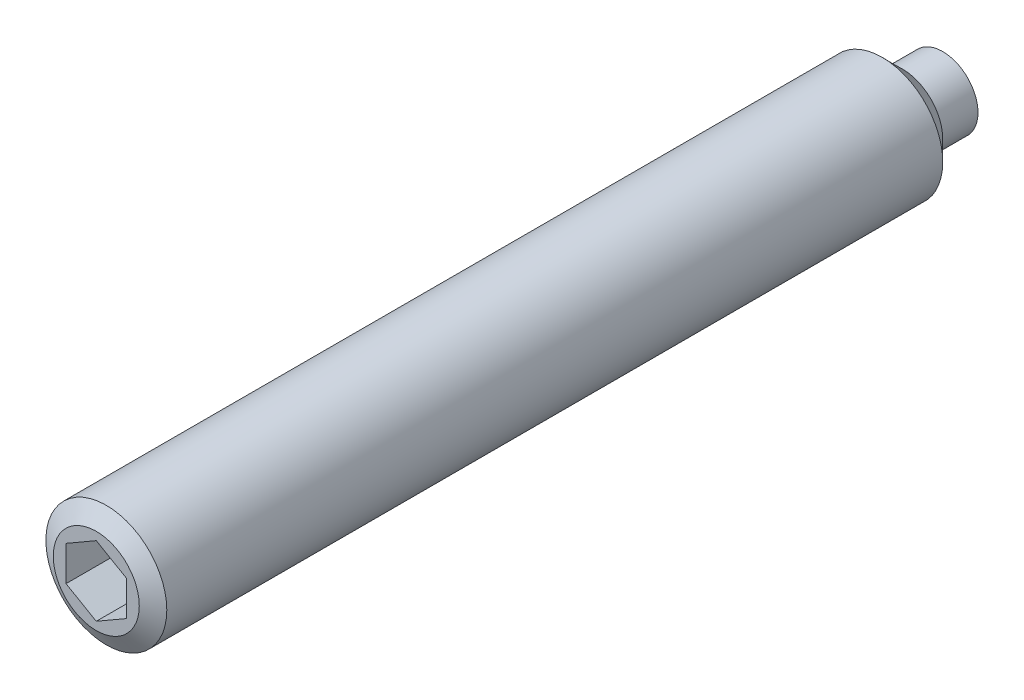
ISO-10303-21;
HEADER;
FILE_DESCRIPTION(('STEP AP214'),'2;1');
FILE_NAME('part.step','',(''),(''),'','','');
FILE_SCHEMA(('AUTOMOTIVE_DESIGN { 1 0 10303 214 1 1 1 1 }'));
ENDSEC;
DATA;
#1=APPLICATION_CONTEXT('core data for automotive mechanical design processes');
#2=APPLICATION_PROTOCOL_DEFINITION('international standard','automotive_design',2000,#1);
#3=PRODUCT_CONTEXT('',#1,'mechanical');
#4=PRODUCT('Part','Part','',(#3));
#5=PRODUCT_RELATED_PRODUCT_CATEGORY('part','',(#4));
#6=PRODUCT_DEFINITION_FORMATION('','',#4);
#7=PRODUCT_DEFINITION_CONTEXT('part definition',#1,'design');
#8=PRODUCT_DEFINITION('design','',#6,#7);
#9=PRODUCT_DEFINITION_SHAPE('','',#8);
#10=(LENGTH_UNIT() NAMED_UNIT(*) SI_UNIT(.MILLI.,.METRE.));
#11=(NAMED_UNIT(*) PLANE_ANGLE_UNIT() SI_UNIT($,.RADIAN.));
#12=(NAMED_UNIT(*) SI_UNIT($,.STERADIAN.) SOLID_ANGLE_UNIT());
#13=UNCERTAINTY_MEASURE_WITH_UNIT(LENGTH_MEASURE(1.E-05),#10,'distance_accuracy_value','');
#14=(GEOMETRIC_REPRESENTATION_CONTEXT(3) GLOBAL_UNCERTAINTY_ASSIGNED_CONTEXT((#13)) GLOBAL_UNIT_ASSIGNED_CONTEXT((#10,
#11,#12)) REPRESENTATION_CONTEXT('',''));
#15=CARTESIAN_POINT('',(0.,0.,0.));
#16=DIRECTION('',(0.,0.,1.));
#17=DIRECTION('',(1.,0.,0.));
#18=AXIS2_PLACEMENT_3D('',#15,#16,#17);
#19=CARTESIAN_POINT('',(1.75,0.,0.));
#20=DIRECTION('',(0.,0.,-1.));
#21=DIRECTION('',(-1.,0.,0.));
#22=AXIS2_PLACEMENT_3D('',#19,#20,#21);
#23=PLANE('',#22);
#24=CARTESIAN_POINT('',(0.,0.,0.));
#25=DIRECTION('',(0.,0.,1.));
#26=DIRECTION('',(1.,0.,0.));
#27=AXIS2_PLACEMENT_3D('',#24,#25,#26);
#28=CIRCLE('',#27,1.75);
#29=CARTESIAN_POINT('',(1.75,0.,0.));
#30=VERTEX_POINT('',#29);
#31=EDGE_CURVE('E124',#30,#30,#28,.T.);
#32=ORIENTED_EDGE('',*,*,#31,.F.);
#33=EDGE_LOOP('',(#32));
#34=FACE_BOUND('',#33,.T.);
#35=ADVANCED_FACE('F14',(#34),#23,.T.);
#36=CARTESIAN_POINT('',(0.,0.,62.));
#37=DIRECTION('',(0.,0.,1.));
#38=DIRECTION('',(1.,0.,0.));
#39=AXIS2_PLACEMENT_3D('',#36,#37,#38);
#40=CYLINDRICAL_SURFACE('',#39,1.75);
#41=CARTESIAN_POINT('',(0.,0.,2.));
#42=DIRECTION('',(0.,0.,1.));
#43=DIRECTION('',(1.,0.,0.));
#44=AXIS2_PLACEMENT_3D('',#41,#42,#43);
#45=CIRCLE('',#44,1.75);
#46=CARTESIAN_POINT('',(1.75,0.,2.));
#47=VERTEX_POINT('',#46);
#48=EDGE_CURVE('E121',#47,#47,#45,.T.);
#49=ORIENTED_EDGE('',*,*,#48,.F.);
#50=EDGE_LOOP('',(#49));
#51=FACE_BOUND('',#50,.T.);
#52=ORIENTED_EDGE('',*,*,#31,.T.);
#53=EDGE_LOOP('',(#52));
#54=FACE_BOUND('',#53,.T.);
#55=ADVANCED_FACE('F149',(#51,#54),#40,.T.);
#56=CARTESIAN_POINT('',(3.,0.,2.));
#57=DIRECTION('',(0.,0.,-1.));
#58=DIRECTION('',(-1.,0.,0.));
#59=AXIS2_PLACEMENT_3D('',#56,#57,#58);
#60=PLANE('',#59);
#61=CARTESIAN_POINT('',(0.,0.,2.));
#62=DIRECTION('',(0.,0.,-1.));
#63=DIRECTION('',(-1.,0.,0.));
#64=AXIS2_PLACEMENT_3D('',#61,#62,#63);
#65=CIRCLE('',#64,2.);
#66=CARTESIAN_POINT('',(-2.,0.,2.));
#67=VERTEX_POINT('',#66);
#68=EDGE_CURVE('E130',#67,#67,#65,.T.);
#69=ORIENTED_EDGE('',*,*,#68,.T.);
#70=EDGE_LOOP('',(#69));
#71=FACE_BOUND('',#70,.T.);
#72=ORIENTED_EDGE('',*,*,#48,.T.);
#73=EDGE_LOOP('',(#72));
#74=FACE_BOUND('',#73,.T.);
#75=ADVANCED_FACE('F155',(#71,#74),#60,.T.);
#76=CARTESIAN_POINT('',(0.,0.,62.));
#77=DIRECTION('',(0.,0.,1.));
#78=DIRECTION('',(1.,0.,0.));
#79=AXIS2_PLACEMENT_3D('',#76,#77,#78);
#80=CYLINDRICAL_SURFACE('',#79,3.);
#81=CARTESIAN_POINT('',(0.,0.,41.5));
#82=DIRECTION('',(0.,0.,1.));
#83=DIRECTION('',(1.,0.,0.));
#84=AXIS2_PLACEMENT_3D('',#81,#82,#83);
#85=CIRCLE('',#84,3.);
#86=CARTESIAN_POINT('',(3.,0.,41.5));
#87=VERTEX_POINT('',#86);
#88=EDGE_CURVE('E9',#87,#87,#85,.F.);
#89=ORIENTED_EDGE('',*,*,#88,.T.);
#90=EDGE_LOOP('',(#89));
#91=FACE_BOUND('',#90,.T.);
#92=CARTESIAN_POINT('',(0.,0.,3.));
#93=DIRECTION('',(0.,0.,-1.));
#94=DIRECTION('',(-1.,0.,0.));
#95=AXIS2_PLACEMENT_3D('',#92,#93,#94);
#96=CIRCLE('',#95,3.);
#97=CARTESIAN_POINT('',(-3.,0.,3.));
#98=VERTEX_POINT('',#97);
#99=EDGE_CURVE('E127',#98,#98,#96,.F.);
#100=ORIENTED_EDGE('',*,*,#99,.T.);
#101=EDGE_LOOP('',(#100));
#102=FACE_BOUND('',#101,.T.);
#103=ADVANCED_FACE('F162',(#91,#102),#80,.T.);
#104=CARTESIAN_POINT('',(0.,0.,42.));
#105=DIRECTION('',(0.,0.,1.));
#106=DIRECTION('',(1.,0.,0.));
#107=AXIS2_PLACEMENT_3D('',#104,#105,#106);
#108=PLANE('',#107);
#109=CARTESIAN_POINT('',(0.,0.,42.));
#110=DIRECTION('',(0.,0.,1.));
#111=DIRECTION('',(1.,0.,0.));
#112=AXIS2_PLACEMENT_3D('',#109,#110,#111);
#113=CIRCLE('',#112,2.13397459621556);
#114=CARTESIAN_POINT('',(2.13397459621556,0.,42.));
#115=VERTEX_POINT('',#114);
#116=EDGE_CURVE('E22',#115,#115,#113,.T.);
#117=ORIENTED_EDGE('',*,*,#116,.T.);
#118=EDGE_LOOP('',(#117));
#119=FACE_BOUND('',#118,.T.);
#120=DIRECTION('',(0.86602540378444,-0.5,0.));
#121=VECTOR('',#120,1.);
#122=CARTESIAN_POINT('',(-1.5,-0.866025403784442,42.));
#123=LINE('',#122,#121);
#124=CARTESIAN_POINT('',(-1.5,-0.866025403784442,42.));
#125=VERTEX_POINT('',#124);
#126=CARTESIAN_POINT('',(0.,-1.73205080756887,42.));
#127=VERTEX_POINT('',#126);
#128=EDGE_CURVE('E29',#125,#127,#123,.T.);
#129=ORIENTED_EDGE('',*,*,#128,.F.);
#130=DIRECTION('',(0.,-1.,0.));
#131=VECTOR('',#130,1.);
#132=CARTESIAN_POINT('',(-1.5,0.866025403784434,42.));
#133=LINE('',#132,#131);
#134=CARTESIAN_POINT('',(-1.5,0.866025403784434,42.));
#135=VERTEX_POINT('',#134);
#136=EDGE_CURVE('E97',#135,#125,#133,.T.);
#137=ORIENTED_EDGE('',*,*,#136,.F.);
#138=DIRECTION('',(0.866025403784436,0.5,0.));
#139=VECTOR('',#138,1.);
#140=CARTESIAN_POINT('',(-1.5,0.866025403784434,42.));
#141=LINE('',#140,#139);
#142=CARTESIAN_POINT('',(0.,1.73205080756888,42.));
#143=VERTEX_POINT('',#142);
#144=EDGE_CURVE('E92',#135,#143,#141,.T.);
#145=ORIENTED_EDGE('',*,*,#144,.T.);
#146=DIRECTION('',(-0.866025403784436,0.5,0.));
#147=VECTOR('',#146,1.);
#148=CARTESIAN_POINT('',(1.5,0.866025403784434,42.));
#149=LINE('',#148,#147);
#150=CARTESIAN_POINT('',(1.5,0.866025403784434,42.));
#151=VERTEX_POINT('',#150);
#152=EDGE_CURVE('E90',#151,#143,#149,.T.);
#153=ORIENTED_EDGE('',*,*,#152,.F.);
#154=DIRECTION('',(0.,-1.,0.));
#155=VECTOR('',#154,1.);
#156=CARTESIAN_POINT('',(1.5,0.866025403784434,42.));
#157=LINE('',#156,#155);
#158=CARTESIAN_POINT('',(1.5,-0.866025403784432,42.));
#159=VERTEX_POINT('',#158);
#160=EDGE_CURVE('E72',#151,#159,#157,.T.);
#161=ORIENTED_EDGE('',*,*,#160,.T.);
#162=DIRECTION('',(-0.866025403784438,-0.5,0.));
#163=VECTOR('',#162,1.);
#164=CARTESIAN_POINT('',(1.5,-0.866025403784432,42.));
#165=LINE('',#164,#163);
#166=EDGE_CURVE('E83',#159,#127,#165,.T.);
#167=ORIENTED_EDGE('',*,*,#166,.T.);
#168=EDGE_LOOP('',(#129,#137,#145,#153,#161,#167));
#169=FACE_BOUND('',#168,.T.);
#170=ADVANCED_FACE('F87',(#119,#169),#108,.T.);
#171=CARTESIAN_POINT('',(-1.5,-0.866025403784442,39.));
#172=DIRECTION('',(-0.5,-0.86602540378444,0.));
#173=DIRECTION('',(-0.86602540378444,0.5,0.));
#174=AXIS2_PLACEMENT_3D('',#171,#172,#173);
#175=PLANE('',#174);
#176=DIRECTION('',(0.,0.,1.));
#177=VECTOR('',#176,1.);
#178=CARTESIAN_POINT('',(-1.5,-0.866025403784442,39.));
#179=LINE('',#178,#177);
#180=CARTESIAN_POINT('',(-1.5,-0.866025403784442,39.));
#181=VERTEX_POINT('',#180);
#182=EDGE_CURVE('E36',#181,#125,#179,.T.);
#183=ORIENTED_EDGE('',*,*,#182,.T.);
#184=ORIENTED_EDGE('',*,*,#128,.T.);
#185=DIRECTION('',(0.,0.,1.));
#186=VECTOR('',#185,1.);
#187=CARTESIAN_POINT('',(0.,-1.73205080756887,39.));
#188=LINE('',#187,#186);
#189=CARTESIAN_POINT('',(0.,-1.73205080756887,39.));
#190=VERTEX_POINT('',#189);
#191=EDGE_CURVE('E80',#190,#127,#188,.T.);
#192=ORIENTED_EDGE('',*,*,#191,.F.);
#193=DIRECTION('',(0.86602540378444,-0.5,0.));
#194=VECTOR('',#193,1.);
#195=CARTESIAN_POINT('',(-1.5,-0.866025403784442,39.));
#196=LINE('',#195,#194);
#197=EDGE_CURVE('E99',#181,#190,#196,.T.);
#198=ORIENTED_EDGE('',*,*,#197,.F.);
#199=EDGE_LOOP('',(#183,#184,#192,#198));
#200=FACE_BOUND('',#199,.T.);
#201=ADVANCED_FACE('F169',(#200),#175,.F.);
#202=CARTESIAN_POINT('',(-1.5,0.866025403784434,39.));
#203=DIRECTION('',(-1.,0.,0.));
#204=DIRECTION('',(0.,1.,0.));
#205=AXIS2_PLACEMENT_3D('',#202,#203,#204);
#206=PLANE('',#205);
#207=DIRECTION('',(0.,0.,1.));
#208=VECTOR('',#207,1.);
#209=CARTESIAN_POINT('',(-1.5,0.866025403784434,39.));
#210=LINE('',#209,#208);
#211=CARTESIAN_POINT('',(-1.5,0.866025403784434,39.));
#212=VERTEX_POINT('',#211);
#213=EDGE_CURVE('E118',#212,#135,#210,.T.);
#214=ORIENTED_EDGE('',*,*,#213,.T.);
#215=ORIENTED_EDGE('',*,*,#136,.T.);
#216=ORIENTED_EDGE('',*,*,#182,.F.);
#217=DIRECTION('',(0.,-1.,0.));
#218=VECTOR('',#217,1.);
#219=CARTESIAN_POINT('',(-1.5,0.866025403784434,39.));
#220=LINE('',#219,#218);
#221=EDGE_CURVE('E111',#212,#181,#220,.T.);
#222=ORIENTED_EDGE('',*,*,#221,.F.);
#223=EDGE_LOOP('',(#214,#215,#216,#222));
#224=FACE_BOUND('',#223,.T.);
#225=ADVANCED_FACE('F170',(#224),#206,.F.);
#226=CARTESIAN_POINT('',(-1.5,0.866025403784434,39.));
#227=DIRECTION('',(0.5,-0.866025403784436,0.));
#228=DIRECTION('',(-0.866025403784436,-0.5,0.));
#229=AXIS2_PLACEMENT_3D('',#226,#227,#228);
#230=PLANE('',#229);
#231=DIRECTION('',(0.,0.,1.));
#232=VECTOR('',#231,1.);
#233=CARTESIAN_POINT('',(0.,1.73205080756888,39.));
#234=LINE('',#233,#232);
#235=CARTESIAN_POINT('',(0.,1.73205080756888,39.));
#236=VERTEX_POINT('',#235);
#237=EDGE_CURVE('E116',#236,#143,#234,.T.);
#238=ORIENTED_EDGE('',*,*,#237,.T.);
#239=ORIENTED_EDGE('',*,*,#144,.F.);
#240=ORIENTED_EDGE('',*,*,#213,.F.);
#241=DIRECTION('',(0.866025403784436,0.5,0.));
#242=VECTOR('',#241,1.);
#243=CARTESIAN_POINT('',(-1.5,0.866025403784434,39.));
#244=LINE('',#243,#242);
#245=EDGE_CURVE('E108',#212,#236,#244,.T.);
#246=ORIENTED_EDGE('',*,*,#245,.T.);
#247=EDGE_LOOP('',(#238,#239,#240,#246));
#248=FACE_BOUND('',#247,.T.);
#249=ADVANCED_FACE('F173',(#248),#230,.T.);
#250=CARTESIAN_POINT('',(1.5,0.866025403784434,39.));
#251=DIRECTION('',(0.5,0.866025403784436,0.));
#252=DIRECTION('',(0.866025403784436,-0.5,0.));
#253=AXIS2_PLACEMENT_3D('',#250,#251,#252);
#254=PLANE('',#253);
#255=DIRECTION('',(0.,0.,1.));
#256=VECTOR('',#255,1.);
#257=CARTESIAN_POINT('',(1.5,0.866025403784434,39.));
#258=LINE('',#257,#256);
#259=CARTESIAN_POINT('',(1.5,0.866025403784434,39.));
#260=VERTEX_POINT('',#259);
#261=EDGE_CURVE('E79',#260,#151,#258,.T.);
#262=ORIENTED_EDGE('',*,*,#261,.T.);
#263=ORIENTED_EDGE('',*,*,#152,.T.);
#264=ORIENTED_EDGE('',*,*,#237,.F.);
#265=DIRECTION('',(-0.866025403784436,0.5,0.));
#266=VECTOR('',#265,1.);
#267=CARTESIAN_POINT('',(1.5,0.866025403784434,39.));
#268=LINE('',#267,#266);
#269=EDGE_CURVE('E105',#260,#236,#268,.T.);
#270=ORIENTED_EDGE('',*,*,#269,.F.);
#271=EDGE_LOOP('',(#262,#263,#264,#270));
#272=FACE_BOUND('',#271,.T.);
#273=ADVANCED_FACE('F176',(#272),#254,.F.);
#274=CARTESIAN_POINT('',(1.5,0.866025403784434,39.));
#275=DIRECTION('',(-1.,0.,0.));
#276=DIRECTION('',(0.,1.,0.));
#277=AXIS2_PLACEMENT_3D('',#274,#275,#276);
#278=PLANE('',#277);
#279=DIRECTION('',(0.,0.,1.));
#280=VECTOR('',#279,1.);
#281=CARTESIAN_POINT('',(1.5,-0.866025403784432,39.));
#282=LINE('',#281,#280);
#283=CARTESIAN_POINT('',(1.5,-0.866025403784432,39.));
#284=VERTEX_POINT('',#283);
#285=EDGE_CURVE('E68',#284,#159,#282,.T.);
#286=ORIENTED_EDGE('',*,*,#285,.T.);
#287=ORIENTED_EDGE('',*,*,#160,.F.);
#288=ORIENTED_EDGE('',*,*,#261,.F.);
#289=DIRECTION('',(0.,-1.,0.));
#290=VECTOR('',#289,1.);
#291=CARTESIAN_POINT('',(1.5,0.866025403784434,39.));
#292=LINE('',#291,#290);
#293=EDGE_CURVE('E75',#260,#284,#292,.T.);
#294=ORIENTED_EDGE('',*,*,#293,.T.);
#295=EDGE_LOOP('',(#286,#287,#288,#294));
#296=FACE_BOUND('',#295,.T.);
#297=ADVANCED_FACE('F70',(#296),#278,.T.);
#298=CARTESIAN_POINT('',(1.5,-0.866025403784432,39.));
#299=DIRECTION('',(-0.5,0.866025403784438,0.));
#300=DIRECTION('',(0.866025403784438,0.5,0.));
#301=AXIS2_PLACEMENT_3D('',#298,#299,#300);
#302=PLANE('',#301);
#303=DIRECTION('',(-0.866025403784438,-0.5,0.));
#304=VECTOR('',#303,1.);
#305=CARTESIAN_POINT('',(1.5,-0.866025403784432,39.));
#306=LINE('',#305,#304);
#307=EDGE_CURVE('E102',#284,#190,#306,.T.);
#308=ORIENTED_EDGE('',*,*,#307,.T.);
#309=ORIENTED_EDGE('',*,*,#191,.T.);
#310=ORIENTED_EDGE('',*,*,#166,.F.);
#311=ORIENTED_EDGE('',*,*,#285,.F.);
#312=EDGE_LOOP('',(#308,#309,#310,#311));
#313=FACE_BOUND('',#312,.T.);
#314=ADVANCED_FACE('F84',(#313),#302,.T.);
#315=CARTESIAN_POINT('',(-1.5,-0.866025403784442,39.));
#316=DIRECTION('',(0.,0.,-1.));
#317=DIRECTION('',(-1.,0.,0.));
#318=AXIS2_PLACEMENT_3D('',#315,#316,#317);
#319=PLANE('',#318);
#320=ORIENTED_EDGE('',*,*,#197,.T.);
#321=ORIENTED_EDGE('',*,*,#307,.F.);
#322=ORIENTED_EDGE('',*,*,#293,.F.);
#323=ORIENTED_EDGE('',*,*,#269,.T.);
#324=ORIENTED_EDGE('',*,*,#245,.F.);
#325=ORIENTED_EDGE('',*,*,#221,.T.);
#326=EDGE_LOOP('',(#320,#321,#322,#323,#324,#325));
#327=FACE_BOUND('',#326,.T.);
#328=ADVANCED_FACE('F144',(#327),#319,.F.);
#329=CARTESIAN_POINT('',(0.,0.,3.));
#330=DIRECTION('',(0.,0.,1.));
#331=DIRECTION('',(1.,0.,0.));
#332=AXIS2_PLACEMENT_3D('',#329,#330,#331);
#333=CONICAL_SURFACE('',#332,3.,0.785398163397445);
#334=ORIENTED_EDGE('',*,*,#68,.F.);
#335=EDGE_LOOP('',(#334));
#336=FACE_BOUND('',#335,.T.);
#337=ORIENTED_EDGE('',*,*,#99,.F.);
#338=EDGE_LOOP('',(#337));
#339=FACE_BOUND('',#338,.T.);
#340=ADVANCED_FACE('F137',(#336,#339),#333,.T.);
#341=CARTESIAN_POINT('',(0.,0.,42.));
#342=DIRECTION('',(0.,0.,-1.));
#343=DIRECTION('',(-1.,0.,0.));
#344=AXIS2_PLACEMENT_3D('',#341,#342,#343);
#345=CONICAL_SURFACE('',#344,2.13397459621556,1.0471975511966);
#346=ORIENTED_EDGE('',*,*,#88,.F.);
#347=EDGE_LOOP('',(#346));
#348=FACE_BOUND('',#347,.T.);
#349=ORIENTED_EDGE('',*,*,#116,.F.);
#350=EDGE_LOOP('',(#349));
#351=FACE_BOUND('',#350,.T.);
#352=ADVANCED_FACE('F16',(#348,#351),#345,.T.);
#353=CLOSED_SHELL('',(#35,#55,#75,#103,#170,#201,#225,#249,#273,#297,#314,#328,#340,#352));
#354=MANIFOLD_SOLID_BREP('B1',#353);
#355=ADVANCED_BREP_SHAPE_REPRESENTATION('',(#18,#354),#14);
#356=SHAPE_DEFINITION_REPRESENTATION(#9,#355);
ENDSEC;
END-ISO-10303-21;
